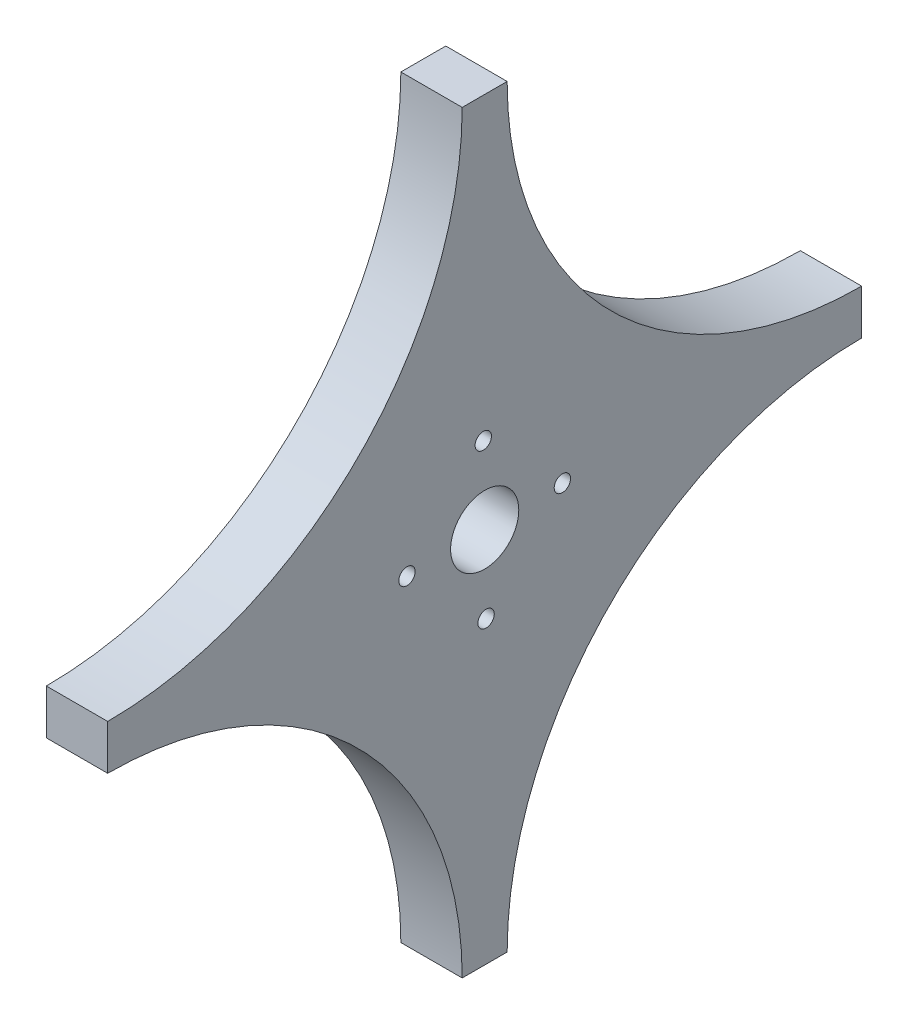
from build123d import *

# Parameters (mm, degrees)
SKETCH1_R           = 3.175
BOSS_EXTRUDE1_DEPTH = 5.715
SKETCH3_R           = 0.762
CUT_EXTRUDE3_DEPTH  = 50.984786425


with BuildPart() as part:
    # Sketch1 → Boss-Extrude1 (new body)
    with BuildSketch(Plane(origin=(0, 0, 0), x_dir=(0, 0, -1), z_dir=(1, 0, 0))):
        with BuildLine():
            Line((2.092801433, 35.112801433), (-2.092801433, 35.112801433))
            ThreePointArc((-2.092801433, 35.112801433), (-11.764135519, 11.764135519), (-35.112801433, 2.092801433))
            Line((-35.112801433, 2.092801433), (-35.112801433, -2.092801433))
            ThreePointArc((-35.112801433, -2.092801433), (-11.764135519, -11.764135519), (-2.092801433, -35.112801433))
            Line((-2.092801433, -35.112801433), (2.092801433, -35.112801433))
            ThreePointArc((2.092801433, -35.112801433), (11.764135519, -11.764135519), (35.112801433, -2.092801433))
            Line((35.112801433, -2.092801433), (35.112801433, 2.092801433))
            ThreePointArc((35.112801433, 2.092801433), (11.764135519, 11.764135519), (2.092801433, 35.112801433))
        make_face()
        Circle(SKETCH1_R, mode=Mode.SUBTRACT)
    extrude(amount=BOSS_EXTRUDE1_DEPTH)

    # Sketch3 → Cut-Extrude3 (cut, through all)
    with BuildSketch(Plane.ZY.offset(-5.715)):
        with Locations((7.237804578, -0.131551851)):
            Circle(SKETCH3_R)
        with Locations((0.131551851, 7.237804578)):
            Circle(SKETCH3_R)
        with Locations((-7.237804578, 0.131551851)):
            Circle(SKETCH3_R)
        with Locations((-0.131551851, -7.237804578)):
            Circle(SKETCH3_R)
    extrude(amount=CUT_EXTRUDE3_DEPTH, mode=Mode.SUBTRACT)


solid = part.part
